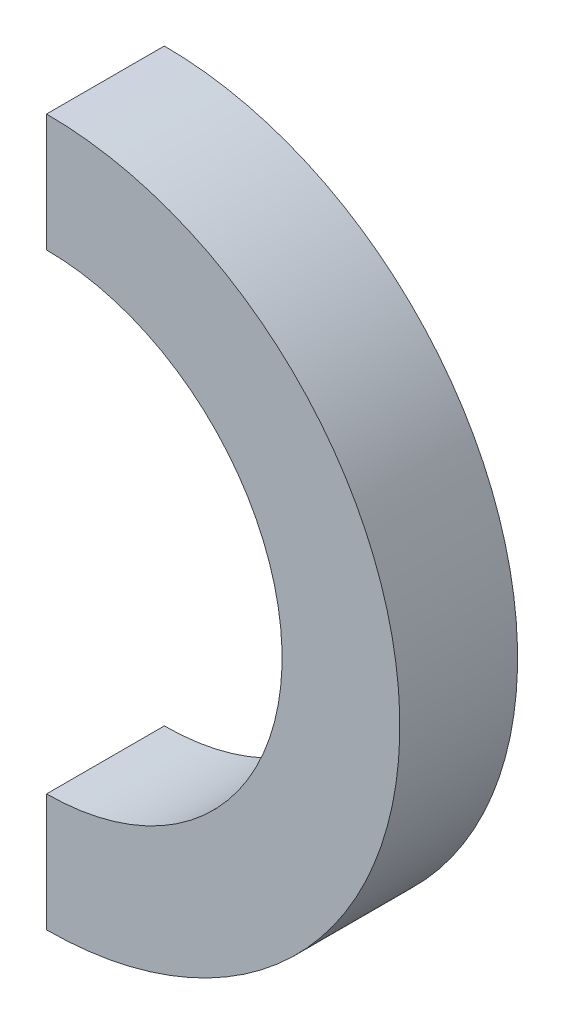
from build123d import *

# Parameters (mm, degrees)
FINGER_DEPTH = 6.35


with BuildPart() as part:
    # Sketch1 → Finger (new body)
    with BuildSketch(Plane.XY):
        with BuildLine():
            Line((0, 19.05), (0, 12.7))
            ThreePointArc((0, 12.7), (12.7, 0), (0, -12.7))
            Line((0, -12.7), (0, -19.05))
            ThreePointArc((0, -19.05), (19.05, 0), (0, 19.05))
        make_face()
    extrude(amount=FINGER_DEPTH)


solid = part.part
